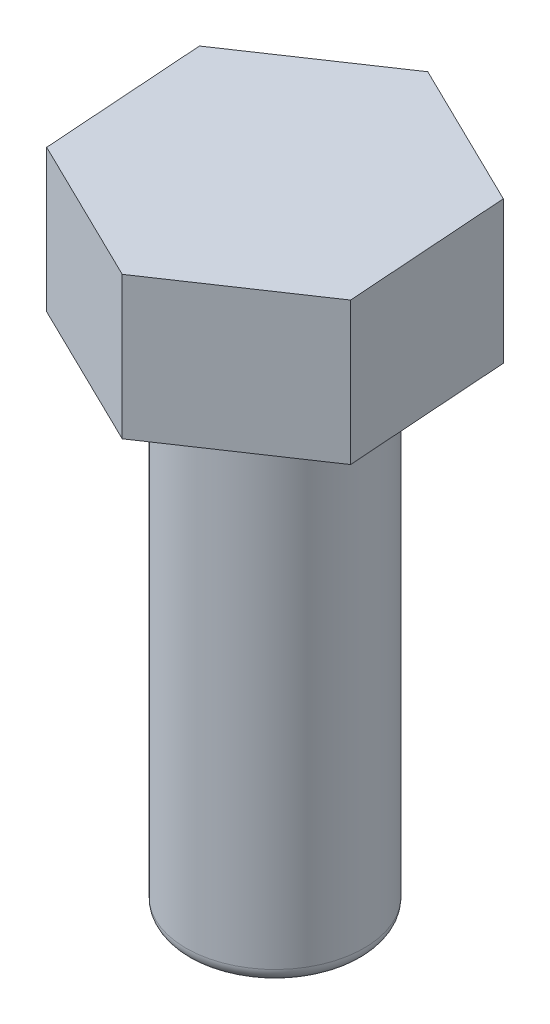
from build123d import *

# Parameters (mm, degrees)
BOSS_EXTRUDE1_DEPTH = 200
SKETCH3_R           = 125
BOSS_EXTRUDE2_DEPTH = 700
FILLET1_R           = 20


with BuildPart() as part:
    # Sketch2 → Boss-Extrude1 (new body)
    with BuildSketch(Plane(origin=(0, 0, 0), x_dir=(1, 0, 0), z_dir=(0, 1, 0))):
        Polygon((207.48060183, -101.415645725), (191.568826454, 128.975649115), (-15.911775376, 230.391294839), (-207.48060183, 101.415645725), (-191.568826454, -128.975649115), (15.911775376, -230.391294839), align=None)
    extrude(amount=-BOSS_EXTRUDE1_DEPTH)

    # Sketch3 → Boss-Extrude2 (add)
    with BuildSketch(Plane(origin=(0, -200, 0), x_dir=(1, 0, 0), z_dir=(0, 1, 0))):
        with Locations(Location((0, 0, 0), (0, 0, 270))):
            Circle(SKETCH3_R)
    extrude(amount=-BOSS_EXTRUDE2_DEPTH)

    # Fillet1
    fillet1_edges = [part.edges().sort_by_distance(p)[0] for p in [
        (0, -900, -125),
    ]]
    fillet(fillet1_edges, radius=FILLET1_R)


solid = part.part
